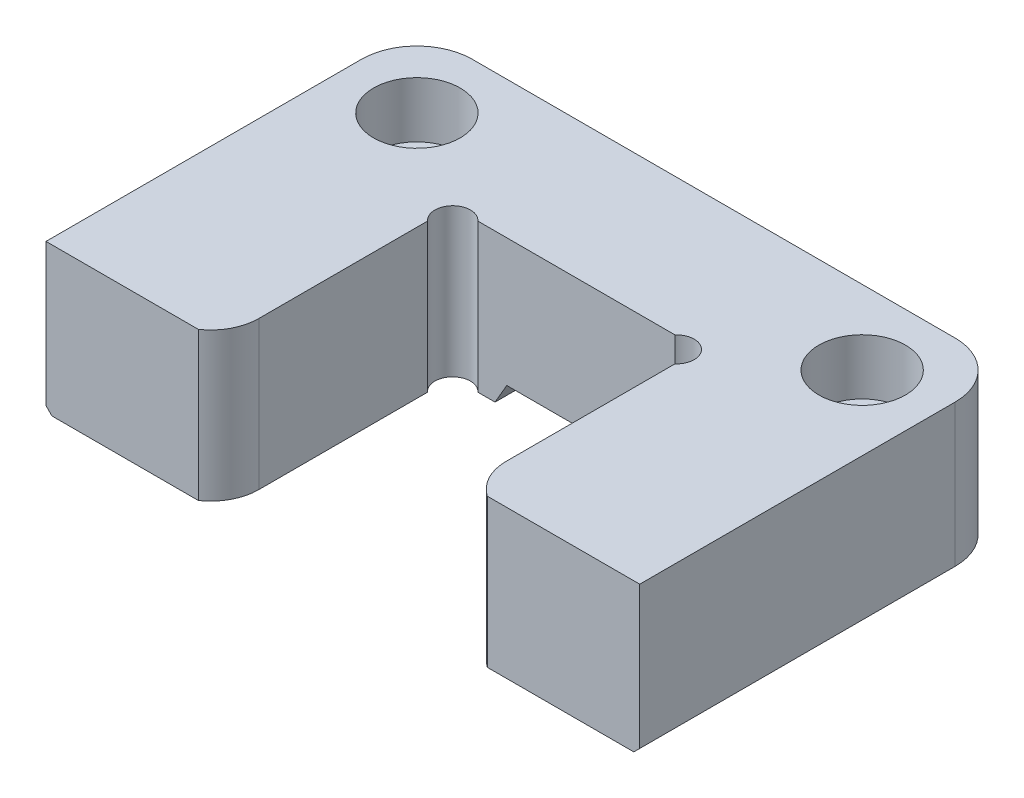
ISO-10303-21;
HEADER;
FILE_DESCRIPTION(('STEP AP214'),'2;1');
FILE_NAME('part.step','',(''),(''),'','','');
FILE_SCHEMA(('AUTOMOTIVE_DESIGN { 1 0 10303 214 1 1 1 1 }'));
ENDSEC;
DATA;
#1=APPLICATION_CONTEXT('core data for automotive mechanical design processes');
#2=APPLICATION_PROTOCOL_DEFINITION('international standard','automotive_design',2000,#1);
#3=PRODUCT_CONTEXT('',#1,'mechanical');
#4=PRODUCT('Part','Part','',(#3));
#5=PRODUCT_RELATED_PRODUCT_CATEGORY('part','',(#4));
#6=PRODUCT_DEFINITION_FORMATION('','',#4);
#7=PRODUCT_DEFINITION_CONTEXT('part definition',#1,'design');
#8=PRODUCT_DEFINITION('design','',#6,#7);
#9=PRODUCT_DEFINITION_SHAPE('','',#8);
#10=(LENGTH_UNIT() NAMED_UNIT(*) SI_UNIT(.MILLI.,.METRE.));
#11=(NAMED_UNIT(*) PLANE_ANGLE_UNIT() SI_UNIT($,.RADIAN.));
#12=(NAMED_UNIT(*) SI_UNIT($,.STERADIAN.) SOLID_ANGLE_UNIT());
#13=UNCERTAINTY_MEASURE_WITH_UNIT(LENGTH_MEASURE(1.E-05),#10,'distance_accuracy_value','');
#14=(GEOMETRIC_REPRESENTATION_CONTEXT(3) GLOBAL_UNCERTAINTY_ASSIGNED_CONTEXT((#13)) GLOBAL_UNIT_ASSIGNED_CONTEXT((#10,
#11,#12)) REPRESENTATION_CONTEXT('',''));
#15=CARTESIAN_POINT('',(0.,0.,0.));
#16=DIRECTION('',(0.,0.,1.));
#17=DIRECTION('',(1.,0.,0.));
#18=AXIS2_PLACEMENT_3D('',#15,#16,#17);
#19=CARTESIAN_POINT('',(-38.1,-19.0246,-47.5996));
#20=DIRECTION('',(0.,-1.,0.));
#21=DIRECTION('',(0.,0.,-1.));
#22=AXIS2_PLACEMENT_3D('',#19,#20,#21);
#23=PLANE('',#22);
#24=CARTESIAN_POINT('',(-28.575,-19.0246,-38.0746));
#25=DIRECTION('',(0.,1.,0.));
#26=DIRECTION('',(0.,0.,1.));
#27=AXIS2_PLACEMENT_3D('',#24,#25,#26);
#28=CIRCLE('',#27,3.26389999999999);
#29=CARTESIAN_POINT('',(-28.575,-19.0246,-34.8107));
#30=VERTEX_POINT('',#29);
#31=EDGE_CURVE('E499',#30,#30,#28,.T.);
#32=ORIENTED_EDGE('',*,*,#31,.T.);
#33=EDGE_LOOP('',(#32));
#34=FACE_BOUND('',#33,.T.);
#35=CARTESIAN_POINT('',(-30.988,-19.0246,-40.4876));
#36=DIRECTION('',(0.,-1.,0.));
#37=DIRECTION('',(0.,0.,-1.));
#38=AXIS2_PLACEMENT_3D('',#35,#36,#37);
#39=CIRCLE('',#38,6.34999999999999);
#40=CARTESIAN_POINT('',(-37.338,-19.0246,-40.4876));
#41=VERTEX_POINT('',#40);
#42=CARTESIAN_POINT('',(-30.988,-19.0246,-46.8376));
#43=VERTEX_POINT('',#42);
#44=EDGE_CURVE('E343',#41,#43,#39,.T.);
#45=ORIENTED_EDGE('',*,*,#44,.T.);
#46=DIRECTION('',(1.,0.,0.));
#47=VECTOR('',#46,1.);
#48=CARTESIAN_POINT('',(-38.1,-19.0246,-46.8376));
#49=LINE('',#48,#47);
#50=CARTESIAN_POINT('',(-10.4415435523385,-19.0246,-46.8376));
#51=VERTEX_POINT('',#50);
#52=EDGE_CURVE('E345',#43,#51,#49,.T.);
#53=ORIENTED_EDGE('',*,*,#52,.T.);
#54=DIRECTION('',(0.,0.,-1.));
#55=VECTOR('',#54,1.);
#56=CARTESIAN_POINT('',(-10.4415435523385,-19.0246,-47.5996));
#57=LINE('',#56,#55);
#58=CARTESIAN_POINT('',(-10.4415435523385,-19.0246,-29.972));
#59=VERTEX_POINT('',#58);
#60=EDGE_CURVE('E320',#59,#51,#57,.T.);
#61=ORIENTED_EDGE('',*,*,#60,.F.);
#62=DIRECTION('',(1.,0.,0.));
#63=VECTOR('',#62,1.);
#64=CARTESIAN_POINT('',(-15.875,-19.0246,-29.972));
#65=LINE('',#64,#63);
#66=CARTESIAN_POINT('',(-12.6471162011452,-19.0246,-29.972));
#67=VERTEX_POINT('',#66);
#68=EDGE_CURVE('E271',#67,#59,#65,.T.);
#69=ORIENTED_EDGE('',*,*,#68,.F.);
#70=CARTESIAN_POINT('',(-14.351,-19.0246,-28.448));
#71=DIRECTION('',(0.,1.,0.));
#72=DIRECTION('',(0.,0.,1.));
#73=AXIS2_PLACEMENT_3D('',#70,#71,#72);
#74=CIRCLE('',#73,2.286);
#75=CARTESIAN_POINT('',(-15.875,-19.0246,-26.7441162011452));
#76=VERTEX_POINT('',#75);
#77=EDGE_CURVE('E233',#67,#76,#74,.T.);
#78=ORIENTED_EDGE('',*,*,#77,.T.);
#79=DIRECTION('',(0.,0.,-1.));
#80=VECTOR('',#79,1.);
#81=CARTESIAN_POINT('',(-15.875,-19.0246,0.));
#82=LINE('',#81,#80);
#83=CARTESIAN_POINT('',(-15.875,-19.0246,-5.08));
#84=VERTEX_POINT('',#83);
#85=EDGE_CURVE('E266',#84,#76,#82,.T.);
#86=ORIENTED_EDGE('',*,*,#85,.F.);
#87=CARTESIAN_POINT('',(-22.0455393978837,-19.0246,-5.07999999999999));
#88=DIRECTION('',(0.,-1.,0.));
#89=DIRECTION('',(0.,0.,1.));
#90=AXIS2_PLACEMENT_3D('',#87,#88,#89);
#91=CIRCLE('',#90,6.17053939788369);
#92=CARTESIAN_POINT('',(-18.5428038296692,-19.0246,0.));
#93=VERTEX_POINT('',#92);
#94=EDGE_CURVE('E242',#84,#93,#91,.T.);
#95=ORIENTED_EDGE('',*,*,#94,.T.);
#96=DIRECTION('',(1.,0.,0.));
#97=VECTOR('',#96,1.);
#98=CARTESIAN_POINT('',(-38.1,-19.0246,0.));
#99=LINE('',#98,#97);
#100=CARTESIAN_POINT('',(-37.338,-19.0246,0.));
#101=VERTEX_POINT('',#100);
#102=EDGE_CURVE('E264',#101,#93,#99,.T.);
#103=ORIENTED_EDGE('',*,*,#102,.F.);
#104=DIRECTION('',(0.,0.,-1.));
#105=VECTOR('',#104,1.);
#106=CARTESIAN_POINT('',(-37.338,-19.0246,-47.5996));
#107=LINE('',#106,#105);
#108=EDGE_CURVE('E341',#101,#41,#107,.T.);
#109=ORIENTED_EDGE('',*,*,#108,.T.);
#110=EDGE_LOOP('',(#45,#53,#61,#69,#78,#86,#95,#103,#109));
#111=FACE_BOUND('',#110,.T.);
#112=ADVANCED_FACE('F35',(#34,#111),#23,.T.);
#113=CARTESIAN_POINT('',(-38.1,-19.0246,0.));
#114=DIRECTION('',(-1.,0.,0.));
#115=DIRECTION('',(0.,0.,1.));
#116=AXIS2_PLACEMENT_3D('',#113,#114,#115);
#117=PLANE('',#116);
#118=DIRECTION('',(0.,1.,0.));
#119=VECTOR('',#118,1.);
#120=CARTESIAN_POINT('',(-38.1,-19.0246,-40.4876));
#121=LINE('',#120,#119);
#122=CARTESIAN_POINT('',(-38.1,0.,-40.4876));
#123=VERTEX_POINT('',#122);
#124=CARTESIAN_POINT('',(-38.1,-18.2626,-40.4876));
#125=VERTEX_POINT('',#124);
#126=EDGE_CURVE('E312',#123,#125,#121,.F.);
#127=ORIENTED_EDGE('',*,*,#126,.T.);
#128=DIRECTION('',(0.,0.,1.));
#129=VECTOR('',#128,1.);
#130=CARTESIAN_POINT('',(-38.1,-18.2626,0.));
#131=LINE('',#130,#129);
#132=CARTESIAN_POINT('',(-38.1,-18.2626,0.));
#133=VERTEX_POINT('',#132);
#134=EDGE_CURVE('E350',#125,#133,#131,.T.);
#135=ORIENTED_EDGE('',*,*,#134,.T.);
#136=DIRECTION('',(0.,1.,0.));
#137=VECTOR('',#136,1.);
#138=CARTESIAN_POINT('',(-38.1,-19.0246,0.));
#139=LINE('',#138,#137);
#140=CARTESIAN_POINT('',(-38.1,0.,0.));
#141=VERTEX_POINT('',#140);
#142=EDGE_CURVE('E278',#133,#141,#139,.T.);
#143=ORIENTED_EDGE('',*,*,#142,.T.);
#144=DIRECTION('',(0.,0.,1.));
#145=VECTOR('',#144,1.);
#146=CARTESIAN_POINT('',(-38.1,0.,0.));
#147=LINE('',#146,#145);
#148=EDGE_CURVE('E256',#123,#141,#147,.T.);
#149=ORIENTED_EDGE('',*,*,#148,.F.);
#150=EDGE_LOOP('',(#127,#135,#143,#149));
#151=FACE_BOUND('',#150,.T.);
#152=ADVANCED_FACE('F425',(#151),#117,.T.);
#153=CARTESIAN_POINT('',(-38.1,-19.0246,-47.5996));
#154=DIRECTION('',(0.,0.,-1.));
#155=DIRECTION('',(-1.,0.,0.));
#156=AXIS2_PLACEMENT_3D('',#153,#154,#155);
#157=PLANE('',#156);
#158=DIRECTION('',(0.,1.,0.));
#159=VECTOR('',#158,1.);
#160=CARTESIAN_POINT('',(30.988,-19.0246,-47.5996));
#161=LINE('',#160,#159);
#162=CARTESIAN_POINT('',(30.988,0.,-47.5996));
#163=VERTEX_POINT('',#162);
#164=CARTESIAN_POINT('',(30.988,-18.2626,-47.5996));
#165=VERTEX_POINT('',#164);
#166=EDGE_CURVE('E310',#163,#165,#161,.F.);
#167=ORIENTED_EDGE('',*,*,#166,.T.);
#168=DIRECTION('',(-1.,0.,0.));
#169=VECTOR('',#168,1.);
#170=CARTESIAN_POINT('',(-38.1,-18.2626,-47.5996));
#171=LINE('',#170,#169);
#172=CARTESIAN_POINT('',(10.001602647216,-18.2626,-47.5996));
#173=VERTEX_POINT('',#172);
#174=EDGE_CURVE('E337',#165,#173,#171,.T.);
#175=ORIENTED_EDGE('',*,*,#174,.T.);
#176=DIRECTION('',(0.499999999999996,-0.866025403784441,0.));
#177=VECTOR('',#176,1.);
#178=CARTESIAN_POINT('',(9.525,-17.4371,-47.5996));
#179=LINE('',#178,#177);
#180=CARTESIAN_POINT('',(9.525,-17.4371,-47.5996));
#181=VERTEX_POINT('',#180);
#182=EDGE_CURVE('E201',#181,#173,#179,.T.);
#183=ORIENTED_EDGE('',*,*,#182,.F.);
#184=DIRECTION('',(1.,0.,0.));
#185=VECTOR('',#184,1.);
#186=CARTESIAN_POINT('',(9.525,-17.4371,-47.5996));
#187=LINE('',#186,#185);
#188=CARTESIAN_POINT('',(-9.525,-17.4371,-47.5996));
#189=VERTEX_POINT('',#188);
#190=EDGE_CURVE('E195',#189,#181,#187,.T.);
#191=ORIENTED_EDGE('',*,*,#190,.F.);
#192=DIRECTION('',(0.499999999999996,0.866025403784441,0.));
#193=VECTOR('',#192,1.);
#194=CARTESIAN_POINT('',(-9.525,-17.4371,-47.5996));
#195=LINE('',#194,#193);
#196=CARTESIAN_POINT('',(-10.001602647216,-18.2626,-47.5996));
#197=VERTEX_POINT('',#196);
#198=EDGE_CURVE('E204',#197,#189,#195,.T.);
#199=ORIENTED_EDGE('',*,*,#198,.F.);
#200=DIRECTION('',(-1.,0.,0.));
#201=VECTOR('',#200,1.);
#202=CARTESIAN_POINT('',(-38.1,-18.2626,-47.5996));
#203=LINE('',#202,#201);
#204=CARTESIAN_POINT('',(-30.988,-18.2626,-47.5996));
#205=VERTEX_POINT('',#204);
#206=EDGE_CURVE('E335',#197,#205,#203,.T.);
#207=ORIENTED_EDGE('',*,*,#206,.T.);
#208=DIRECTION('',(0.,1.,0.));
#209=VECTOR('',#208,1.);
#210=CARTESIAN_POINT('',(-30.988,-19.0246,-47.5996));
#211=LINE('',#210,#209);
#212=CARTESIAN_POINT('',(-30.988,0.,-47.5996));
#213=VERTEX_POINT('',#212);
#214=EDGE_CURVE('E308',#205,#213,#211,.T.);
#215=ORIENTED_EDGE('',*,*,#214,.T.);
#216=DIRECTION('',(-1.,0.,0.));
#217=VECTOR('',#216,1.);
#218=CARTESIAN_POINT('',(-38.1,0.,-47.5996));
#219=LINE('',#218,#217);
#220=EDGE_CURVE('E267',#163,#213,#219,.T.);
#221=ORIENTED_EDGE('',*,*,#220,.F.);
#222=EDGE_LOOP('',(#167,#175,#183,#191,#199,#207,#215,#221));
#223=FACE_BOUND('',#222,.T.);
#224=ADVANCED_FACE('F215',(#223),#157,.T.);
#225=CARTESIAN_POINT('',(38.1,-19.0246,0.));
#226=DIRECTION('',(1.,0.,0.));
#227=DIRECTION('',(0.,0.,-1.));
#228=AXIS2_PLACEMENT_3D('',#225,#226,#227);
#229=PLANE('',#228);
#230=DIRECTION('',(0.,1.,0.));
#231=VECTOR('',#230,1.);
#232=CARTESIAN_POINT('',(38.1,-19.0246,0.));
#233=LINE('',#232,#231);
#234=CARTESIAN_POINT('',(38.1,-18.2626,0.));
#235=VERTEX_POINT('',#234);
#236=CARTESIAN_POINT('',(38.1,0.,0.));
#237=VERTEX_POINT('',#236);
#238=EDGE_CURVE('E299',#235,#237,#233,.T.);
#239=ORIENTED_EDGE('',*,*,#238,.F.);
#240=DIRECTION('',(0.,0.,-1.));
#241=VECTOR('',#240,1.);
#242=CARTESIAN_POINT('',(38.1,-18.2626,0.));
#243=LINE('',#242,#241);
#244=CARTESIAN_POINT('',(38.1,-18.2626,-40.4876));
#245=VERTEX_POINT('',#244);
#246=EDGE_CURVE('E322',#235,#245,#243,.T.);
#247=ORIENTED_EDGE('',*,*,#246,.T.);
#248=DIRECTION('',(0.,1.,0.));
#249=VECTOR('',#248,1.);
#250=CARTESIAN_POINT('',(38.1,-19.0246,-40.4876));
#251=LINE('',#250,#249);
#252=CARTESIAN_POINT('',(38.1,0.,-40.4876));
#253=VERTEX_POINT('',#252);
#254=EDGE_CURVE('E301',#245,#253,#251,.T.);
#255=ORIENTED_EDGE('',*,*,#254,.T.);
#256=DIRECTION('',(0.,0.,-1.));
#257=VECTOR('',#256,1.);
#258=CARTESIAN_POINT('',(38.1,0.,0.));
#259=LINE('',#258,#257);
#260=EDGE_CURVE('E294',#237,#253,#259,.T.);
#261=ORIENTED_EDGE('',*,*,#260,.F.);
#262=EDGE_LOOP('',(#239,#247,#255,#261));
#263=FACE_BOUND('',#262,.T.);
#264=ADVANCED_FACE('F411',(#263),#229,.T.);
#265=CARTESIAN_POINT('',(15.875,-19.0246,0.));
#266=DIRECTION('',(0.,0.,1.));
#267=DIRECTION('',(1.,0.,0.));
#268=AXIS2_PLACEMENT_3D('',#265,#266,#267);
#269=PLANE('',#268);
#270=DIRECTION('',(1.,0.,0.));
#271=VECTOR('',#270,1.);
#272=CARTESIAN_POINT('',(15.875,-19.0246,0.));
#273=LINE('',#272,#271);
#274=CARTESIAN_POINT('',(18.5428038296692,-19.0246,0.));
#275=VERTEX_POINT('',#274);
#276=CARTESIAN_POINT('',(37.338,-19.0246,0.));
#277=VERTEX_POINT('',#276);
#278=EDGE_CURVE('E275',#275,#277,#273,.T.);
#279=ORIENTED_EDGE('',*,*,#278,.T.);
#280=DIRECTION('',(-0.707106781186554,-0.707106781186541,0.));
#281=VECTOR('',#280,1.);
#282=CARTESIAN_POINT('',(26.6064999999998,-29.7561,0.));
#283=LINE('',#282,#281);
#284=EDGE_CURVE('E331',#277,#235,#283,.F.);
#285=ORIENTED_EDGE('',*,*,#284,.T.);
#286=ORIENTED_EDGE('',*,*,#238,.T.);
#287=DIRECTION('',(1.,0.,0.));
#288=VECTOR('',#287,1.);
#289=CARTESIAN_POINT('',(15.875,0.,0.));
#290=LINE('',#289,#288);
#291=CARTESIAN_POINT('',(18.5428038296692,0.,0.));
#292=VERTEX_POINT('',#291);
#293=EDGE_CURVE('E291',#292,#237,#290,.T.);
#294=ORIENTED_EDGE('',*,*,#293,.F.);
#295=DIRECTION('',(0.,1.,0.));
#296=VECTOR('',#295,1.);
#297=CARTESIAN_POINT('',(18.5428038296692,-19.0246,0.));
#298=LINE('',#297,#296);
#299=EDGE_CURVE('E260',#275,#292,#298,.T.);
#300=ORIENTED_EDGE('',*,*,#299,.F.);
#301=EDGE_LOOP('',(#279,#285,#286,#294,#300));
#302=FACE_BOUND('',#301,.T.);
#303=ADVANCED_FACE('F394',(#302),#269,.T.);
#304=CARTESIAN_POINT('',(15.875,-19.0246,0.));
#305=DIRECTION('',(-1.,0.,0.));
#306=DIRECTION('',(0.,0.,1.));
#307=AXIS2_PLACEMENT_3D('',#304,#305,#306);
#308=PLANE('',#307);
#309=DIRECTION('',(0.,1.,0.));
#310=VECTOR('',#309,1.);
#311=CARTESIAN_POINT('',(15.875,-19.0246,-26.7441162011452));
#312=LINE('',#311,#310);
#313=CARTESIAN_POINT('',(15.875,-19.0246,-26.7441162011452));
#314=VERTEX_POINT('',#313);
#315=CARTESIAN_POINT('',(15.875,0.,-26.7441162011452));
#316=VERTEX_POINT('',#315);
#317=EDGE_CURVE('E230',#314,#316,#312,.T.);
#318=ORIENTED_EDGE('',*,*,#317,.F.);
#319=DIRECTION('',(0.,0.,1.));
#320=VECTOR('',#319,1.);
#321=CARTESIAN_POINT('',(15.875,-19.0246,0.));
#322=LINE('',#321,#320);
#323=CARTESIAN_POINT('',(15.875,-19.0246,-5.08));
#324=VERTEX_POINT('',#323);
#325=EDGE_CURVE('E273',#314,#324,#322,.T.);
#326=ORIENTED_EDGE('',*,*,#325,.T.);
#327=DIRECTION('',(0.,1.,0.));
#328=VECTOR('',#327,1.);
#329=CARTESIAN_POINT('',(15.875,-19.0246,-5.08));
#330=LINE('',#329,#328);
#331=CARTESIAN_POINT('',(15.875,0.,-5.08));
#332=VERTEX_POINT('',#331);
#333=EDGE_CURVE('E257',#324,#332,#330,.T.);
#334=ORIENTED_EDGE('',*,*,#333,.T.);
#335=DIRECTION('',(0.,0.,1.));
#336=VECTOR('',#335,1.);
#337=CARTESIAN_POINT('',(15.875,0.,0.));
#338=LINE('',#337,#336);
#339=EDGE_CURVE('E289',#316,#332,#338,.T.);
#340=ORIENTED_EDGE('',*,*,#339,.F.);
#341=EDGE_LOOP('',(#318,#326,#334,#340));
#342=FACE_BOUND('',#341,.T.);
#343=ADVANCED_FACE('F383',(#342),#308,.T.);
#344=CARTESIAN_POINT('',(-15.875,-19.0246,-29.972));
#345=DIRECTION('',(0.,0.,1.));
#346=DIRECTION('',(1.,0.,0.));
#347=AXIS2_PLACEMENT_3D('',#344,#345,#346);
#348=PLANE('',#347);
#349=DIRECTION('',(-0.499999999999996,-0.866025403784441,0.));
#350=VECTOR('',#349,1.);
#351=CARTESIAN_POINT('',(-11.7999076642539,-21.3773556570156,-29.972));
#352=LINE('',#351,#350);
#353=CARTESIAN_POINT('',(-8.93559094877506,-16.4162135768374,-29.972));
#354=VERTEX_POINT('',#353);
#355=EDGE_CURVE('E50',#354,#59,#352,.T.);
#356=ORIENTED_EDGE('',*,*,#355,.F.);
#357=DIRECTION('',(1.,0.,0.));
#358=VECTOR('',#357,1.);
#359=CARTESIAN_POINT('',(9.525,-16.4162135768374,-29.972));
#360=LINE('',#359,#358);
#361=CARTESIAN_POINT('',(8.93559094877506,-16.4162135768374,-29.972));
#362=VERTEX_POINT('',#361);
#363=EDGE_CURVE('E365',#354,#362,#360,.T.);
#364=ORIENTED_EDGE('',*,*,#363,.T.);
#365=DIRECTION('',(-0.499999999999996,0.866025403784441,0.));
#366=VECTOR('',#365,1.);
#367=CARTESIAN_POINT('',(3.86240766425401,-7.6292023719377,-29.972));
#368=LINE('',#367,#366);
#369=CARTESIAN_POINT('',(10.4415435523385,-19.0246,-29.972));
#370=VERTEX_POINT('',#369);
#371=EDGE_CURVE('E57',#370,#362,#368,.T.);
#372=ORIENTED_EDGE('',*,*,#371,.F.);
#373=CARTESIAN_POINT('',(12.6471162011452,-19.0246,-29.972));
#374=VERTEX_POINT('',#373);
#375=EDGE_CURVE('E270',#370,#374,#65,.T.);
#376=ORIENTED_EDGE('',*,*,#375,.T.);
#377=DIRECTION('',(0.,1.,0.));
#378=VECTOR('',#377,1.);
#379=CARTESIAN_POINT('',(12.6471162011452,-19.0246,-29.972));
#380=LINE('',#379,#378);
#381=CARTESIAN_POINT('',(12.6471162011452,0.,-29.972));
#382=VERTEX_POINT('',#381);
#383=EDGE_CURVE('E227',#382,#374,#380,.F.);
#384=ORIENTED_EDGE('',*,*,#383,.F.);
#385=DIRECTION('',(1.,0.,0.));
#386=VECTOR('',#385,1.);
#387=CARTESIAN_POINT('',(-15.875,0.,-29.972));
#388=LINE('',#387,#386);
#389=CARTESIAN_POINT('',(-12.6471162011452,0.,-29.972));
#390=VERTEX_POINT('',#389);
#391=EDGE_CURVE('E286',#390,#382,#388,.T.);
#392=ORIENTED_EDGE('',*,*,#391,.F.);
#393=DIRECTION('',(0.,1.,0.));
#394=VECTOR('',#393,1.);
#395=CARTESIAN_POINT('',(-12.6471162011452,-19.0246,-29.972));
#396=LINE('',#395,#394);
#397=EDGE_CURVE('E239',#67,#390,#396,.T.);
#398=ORIENTED_EDGE('',*,*,#397,.F.);
#399=ORIENTED_EDGE('',*,*,#68,.T.);
#400=EDGE_LOOP('',(#356,#364,#372,#376,#384,#392,#398,#399));
#401=FACE_BOUND('',#400,.T.);
#402=ADVANCED_FACE('F370',(#401),#348,.T.);
#403=CARTESIAN_POINT('',(-15.875,-19.0246,0.));
#404=DIRECTION('',(1.,0.,0.));
#405=DIRECTION('',(0.,0.,-1.));
#406=AXIS2_PLACEMENT_3D('',#403,#404,#405);
#407=PLANE('',#406);
#408=DIRECTION('',(0.,1.,0.));
#409=VECTOR('',#408,1.);
#410=CARTESIAN_POINT('',(-15.875,-19.0246,-26.7441162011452));
#411=LINE('',#410,#409);
#412=CARTESIAN_POINT('',(-15.875,0.,-26.7441162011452));
#413=VERTEX_POINT('',#412);
#414=EDGE_CURVE('E236',#413,#76,#411,.F.);
#415=ORIENTED_EDGE('',*,*,#414,.F.);
#416=DIRECTION('',(0.,0.,-1.));
#417=VECTOR('',#416,1.);
#418=CARTESIAN_POINT('',(-15.875,0.,0.));
#419=LINE('',#418,#417);
#420=CARTESIAN_POINT('',(-15.875,0.,-5.08));
#421=VERTEX_POINT('',#420);
#422=EDGE_CURVE('E283',#421,#413,#419,.T.);
#423=ORIENTED_EDGE('',*,*,#422,.F.);
#424=DIRECTION('',(0.,1.,0.));
#425=VECTOR('',#424,1.);
#426=CARTESIAN_POINT('',(-15.875,-19.0246,-5.08));
#427=LINE('',#426,#425);
#428=EDGE_CURVE('E254',#84,#421,#427,.T.);
#429=ORIENTED_EDGE('',*,*,#428,.F.);
#430=ORIENTED_EDGE('',*,*,#85,.T.);
#431=EDGE_LOOP('',(#415,#423,#429,#430));
#432=FACE_BOUND('',#431,.T.);
#433=ADVANCED_FACE('F449',(#432),#407,.T.);
#434=CARTESIAN_POINT('',(-38.1,-19.0246,0.));
#435=DIRECTION('',(0.,0.,1.));
#436=DIRECTION('',(1.,0.,0.));
#437=AXIS2_PLACEMENT_3D('',#434,#435,#436);
#438=PLANE('',#437);
#439=ORIENTED_EDGE('',*,*,#142,.F.);
#440=DIRECTION('',(-0.707106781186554,0.707106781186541,0.));
#441=VECTOR('',#440,1.);
#442=CARTESIAN_POINT('',(-37.719,-18.6436,0.));
#443=LINE('',#442,#441);
#444=EDGE_CURVE('E352',#133,#101,#443,.F.);
#445=ORIENTED_EDGE('',*,*,#444,.T.);
#446=ORIENTED_EDGE('',*,*,#102,.T.);
#447=DIRECTION('',(0.,1.,0.));
#448=VECTOR('',#447,1.);
#449=CARTESIAN_POINT('',(-18.5428038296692,-19.0246,0.));
#450=LINE('',#449,#448);
#451=CARTESIAN_POINT('',(-18.5428038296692,0.,0.));
#452=VERTEX_POINT('',#451);
#453=EDGE_CURVE('E249',#93,#452,#450,.T.);
#454=ORIENTED_EDGE('',*,*,#453,.T.);
#455=DIRECTION('',(1.,0.,0.));
#456=VECTOR('',#455,1.);
#457=CARTESIAN_POINT('',(-38.1,0.,0.));
#458=LINE('',#457,#456);
#459=EDGE_CURVE('E281',#141,#452,#458,.T.);
#460=ORIENTED_EDGE('',*,*,#459,.F.);
#461=EDGE_LOOP('',(#439,#445,#446,#454,#460));
#462=FACE_BOUND('',#461,.T.);
#463=ADVANCED_FACE('F430',(#462),#438,.T.);
#464=CARTESIAN_POINT('',(28.575,-19.0246,-38.0746));
#465=DIRECTION('',(0.,1.,0.));
#466=DIRECTION('',(0.,0.,1.));
#467=AXIS2_PLACEMENT_3D('',#464,#465,#466);
#468=CIRCLE('',#467,3.26389999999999);
#469=CARTESIAN_POINT('',(28.575,-19.0246,-34.8107));
#470=VERTEX_POINT('',#469);
#471=EDGE_CURVE('E361',#470,#470,#468,.T.);
#472=ORIENTED_EDGE('',*,*,#471,.T.);
#473=EDGE_LOOP('',(#472));
#474=FACE_BOUND('',#473,.T.);
#475=CARTESIAN_POINT('',(30.988,-19.0246,-40.4876));
#476=DIRECTION('',(0.,-1.,0.));
#477=DIRECTION('',(0.,0.,-1.));
#478=AXIS2_PLACEMENT_3D('',#475,#476,#477);
#479=CIRCLE('',#478,6.34999999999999);
#480=CARTESIAN_POINT('',(30.988,-19.0246,-46.8376));
#481=VERTEX_POINT('',#480);
#482=CARTESIAN_POINT('',(37.338,-19.0246,-40.4876));
#483=VERTEX_POINT('',#482);
#484=EDGE_CURVE('E327',#481,#483,#479,.T.);
#485=ORIENTED_EDGE('',*,*,#484,.T.);
#486=DIRECTION('',(0.,0.,1.));
#487=VECTOR('',#486,1.);
#488=CARTESIAN_POINT('',(37.338,-19.0246,-47.5996));
#489=LINE('',#488,#487);
#490=EDGE_CURVE('E329',#483,#277,#489,.T.);
#491=ORIENTED_EDGE('',*,*,#490,.T.);
#492=ORIENTED_EDGE('',*,*,#278,.F.);
#493=CARTESIAN_POINT('',(22.0455393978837,-19.0246,-5.07999999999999));
#494=DIRECTION('',(0.,-1.,0.));
#495=DIRECTION('',(0.,0.,-1.));
#496=AXIS2_PLACEMENT_3D('',#493,#494,#495);
#497=CIRCLE('',#496,6.17053939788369);
#498=EDGE_CURVE('E245',#275,#324,#497,.T.);
#499=ORIENTED_EDGE('',*,*,#498,.T.);
#500=ORIENTED_EDGE('',*,*,#325,.F.);
#501=CARTESIAN_POINT('',(14.351,-19.0246,-28.448));
#502=DIRECTION('',(0.,1.,0.));
#503=DIRECTION('',(0.,0.,-1.));
#504=AXIS2_PLACEMENT_3D('',#501,#502,#503);
#505=CIRCLE('',#504,2.286);
#506=EDGE_CURVE('E224',#314,#374,#505,.T.);
#507=ORIENTED_EDGE('',*,*,#506,.T.);
#508=ORIENTED_EDGE('',*,*,#375,.F.);
#509=DIRECTION('',(0.,0.,1.));
#510=VECTOR('',#509,1.);
#511=CARTESIAN_POINT('',(10.4415435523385,-19.0246,-47.5996));
#512=LINE('',#511,#510);
#513=CARTESIAN_POINT('',(10.4415435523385,-19.0246,-46.8376));
#514=VERTEX_POINT('',#513);
#515=EDGE_CURVE('E318',#514,#370,#512,.T.);
#516=ORIENTED_EDGE('',*,*,#515,.F.);
#517=DIRECTION('',(1.,0.,0.));
#518=VECTOR('',#517,1.);
#519=CARTESIAN_POINT('',(-38.1,-19.0246,-46.8376));
#520=LINE('',#519,#518);
#521=EDGE_CURVE('E325',#514,#481,#520,.T.);
#522=ORIENTED_EDGE('',*,*,#521,.T.);
#523=EDGE_LOOP('',(#485,#491,#492,#499,#500,#507,#508,#516,#522));
#524=FACE_BOUND('',#523,.T.);
#525=ADVANCED_FACE('F375',(#474,#524),#23,.T.);
#526=CARTESIAN_POINT('',(-38.1,0.,-47.5996));
#527=DIRECTION('',(0.,-1.,0.));
#528=DIRECTION('',(0.,0.,-1.));
#529=AXIS2_PLACEMENT_3D('',#526,#527,#528);
#530=PLANE('',#529);
#531=CARTESIAN_POINT('',(-28.575,0.,-38.0746));
#532=DIRECTION('',(0.,1.,0.));
#533=DIRECTION('',(0.,0.,1.));
#534=AXIS2_PLACEMENT_3D('',#531,#532,#533);
#535=CIRCLE('',#534,5.55625);
#536=CARTESIAN_POINT('',(-28.575,0.,-32.51835));
#537=VERTEX_POINT('',#536);
#538=EDGE_CURVE('E507',#537,#537,#535,.T.);
#539=ORIENTED_EDGE('',*,*,#538,.F.);
#540=EDGE_LOOP('',(#539));
#541=FACE_BOUND('',#540,.T.);
#542=CARTESIAN_POINT('',(28.575,0.,-38.0746));
#543=DIRECTION('',(0.,1.,0.));
#544=DIRECTION('',(0.,0.,1.));
#545=AXIS2_PLACEMENT_3D('',#542,#543,#544);
#546=CIRCLE('',#545,5.55625);
#547=CARTESIAN_POINT('',(28.575,0.,-32.51835));
#548=VERTEX_POINT('',#547);
#549=EDGE_CURVE('E496',#548,#548,#546,.T.);
#550=ORIENTED_EDGE('',*,*,#549,.F.);
#551=EDGE_LOOP('',(#550));
#552=FACE_BOUND('',#551,.T.);
#553=ORIENTED_EDGE('',*,*,#391,.T.);
#554=CARTESIAN_POINT('',(14.351,0.,-28.448));
#555=DIRECTION('',(0.,-1.,0.));
#556=DIRECTION('',(0.,0.,-1.));
#557=AXIS2_PLACEMENT_3D('',#554,#555,#556);
#558=CIRCLE('',#557,2.286);
#559=EDGE_CURVE('E315',#382,#316,#558,.T.);
#560=ORIENTED_EDGE('',*,*,#559,.T.);
#561=ORIENTED_EDGE('',*,*,#339,.T.);
#562=CARTESIAN_POINT('',(22.0455393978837,0.,-5.07999999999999));
#563=DIRECTION('',(0.,-1.,0.));
#564=DIRECTION('',(0.,0.,-1.));
#565=AXIS2_PLACEMENT_3D('',#562,#563,#564);
#566=CIRCLE('',#565,6.17053939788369);
#567=EDGE_CURVE('E246',#292,#332,#566,.T.);
#568=ORIENTED_EDGE('',*,*,#567,.F.);
#569=ORIENTED_EDGE('',*,*,#293,.T.);
#570=ORIENTED_EDGE('',*,*,#260,.T.);
#571=CARTESIAN_POINT('',(30.988,0.,-40.4876));
#572=DIRECTION('',(0.,-1.,0.));
#573=DIRECTION('',(0.,0.,-1.));
#574=AXIS2_PLACEMENT_3D('',#571,#572,#573);
#575=CIRCLE('',#574,7.112);
#576=EDGE_CURVE('E306',#253,#163,#575,.F.);
#577=ORIENTED_EDGE('',*,*,#576,.T.);
#578=ORIENTED_EDGE('',*,*,#220,.T.);
#579=CARTESIAN_POINT('',(-30.988,0.,-40.4876));
#580=DIRECTION('',(0.,-1.,0.));
#581=DIRECTION('',(0.,0.,-1.));
#582=AXIS2_PLACEMENT_3D('',#579,#580,#581);
#583=CIRCLE('',#582,7.112);
#584=EDGE_CURVE('E304',#213,#123,#583,.F.);
#585=ORIENTED_EDGE('',*,*,#584,.T.);
#586=ORIENTED_EDGE('',*,*,#148,.T.);
#587=ORIENTED_EDGE('',*,*,#459,.T.);
#588=CARTESIAN_POINT('',(-22.0455393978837,0.,-5.07999999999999));
#589=DIRECTION('',(0.,-1.,0.));
#590=DIRECTION('',(0.,0.,1.));
#591=AXIS2_PLACEMENT_3D('',#588,#589,#590);
#592=CIRCLE('',#591,6.17053939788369);
#593=EDGE_CURVE('E241',#421,#452,#592,.T.);
#594=ORIENTED_EDGE('',*,*,#593,.F.);
#595=ORIENTED_EDGE('',*,*,#422,.T.);
#596=CARTESIAN_POINT('',(-14.351,0.,-28.448));
#597=DIRECTION('',(0.,1.,0.));
#598=DIRECTION('',(0.,0.,1.));
#599=AXIS2_PLACEMENT_3D('',#596,#597,#598);
#600=CIRCLE('',#599,2.286);
#601=EDGE_CURVE('E232',#390,#413,#600,.T.);
#602=ORIENTED_EDGE('',*,*,#601,.F.);
#603=EDGE_LOOP('',(#553,#560,#561,#568,#569,#570,#577,#578,#585,#586,#587,#594,#595,#602));
#604=FACE_BOUND('',#603,.T.);
#605=ADVANCED_FACE('F387',(#541,#552,#604),#530,.F.);
#606=CARTESIAN_POINT('',(30.988,-19.0246,-40.4876));
#607=DIRECTION('',(0.,1.,0.));
#608=DIRECTION('',(0.,0.,1.));
#609=AXIS2_PLACEMENT_3D('',#606,#607,#608);
#610=CYLINDRICAL_SURFACE('',#609,7.112);
#611=ORIENTED_EDGE('',*,*,#254,.F.);
#612=CARTESIAN_POINT('',(30.988,-18.2626,-40.4876));
#613=DIRECTION('',(0.,-1.,0.));
#614=DIRECTION('',(0.,0.,-1.));
#615=AXIS2_PLACEMENT_3D('',#612,#613,#614);
#616=CIRCLE('',#615,7.112);
#617=EDGE_CURVE('E333',#245,#165,#616,.F.);
#618=ORIENTED_EDGE('',*,*,#617,.T.);
#619=ORIENTED_EDGE('',*,*,#166,.F.);
#620=ORIENTED_EDGE('',*,*,#576,.F.);
#621=EDGE_LOOP('',(#611,#618,#619,#620));
#622=FACE_BOUND('',#621,.T.);
#623=ADVANCED_FACE('F414',(#622),#610,.T.);
#624=CARTESIAN_POINT('',(-30.988,-19.0246,-40.4876));
#625=DIRECTION('',(0.,1.,0.));
#626=DIRECTION('',(0.,0.,1.));
#627=AXIS2_PLACEMENT_3D('',#624,#625,#626);
#628=CYLINDRICAL_SURFACE('',#627,7.112);
#629=ORIENTED_EDGE('',*,*,#214,.F.);
#630=CARTESIAN_POINT('',(-30.988,-18.2626,-40.4876));
#631=DIRECTION('',(0.,-1.,0.));
#632=DIRECTION('',(0.,0.,-1.));
#633=AXIS2_PLACEMENT_3D('',#630,#631,#632);
#634=CIRCLE('',#633,7.112);
#635=EDGE_CURVE('E348',#205,#125,#634,.F.);
#636=ORIENTED_EDGE('',*,*,#635,.T.);
#637=ORIENTED_EDGE('',*,*,#126,.F.);
#638=ORIENTED_EDGE('',*,*,#584,.F.);
#639=EDGE_LOOP('',(#629,#636,#637,#638));
#640=FACE_BOUND('',#639,.T.);
#641=ADVANCED_FACE('F421',(#640),#628,.T.);
#642=CARTESIAN_POINT('',(22.0455393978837,-19.0246,-5.07999999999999));
#643=DIRECTION('',(0.,1.,0.));
#644=DIRECTION('',(0.,0.,1.));
#645=AXIS2_PLACEMENT_3D('',#642,#643,#644);
#646=CYLINDRICAL_SURFACE('',#645,6.17053939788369);
#647=ORIENTED_EDGE('',*,*,#567,.T.);
#648=ORIENTED_EDGE('',*,*,#333,.F.);
#649=ORIENTED_EDGE('',*,*,#498,.F.);
#650=ORIENTED_EDGE('',*,*,#299,.T.);
#651=EDGE_LOOP('',(#647,#648,#649,#650));
#652=FACE_BOUND('',#651,.T.);
#653=ADVANCED_FACE('F390',(#652),#646,.T.);
#654=CARTESIAN_POINT('',(-22.0455393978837,-19.0246,-5.07999999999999));
#655=DIRECTION('',(0.,1.,0.));
#656=DIRECTION('',(0.,0.,1.));
#657=AXIS2_PLACEMENT_3D('',#654,#655,#656);
#658=CYLINDRICAL_SURFACE('',#657,6.17053939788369);
#659=ORIENTED_EDGE('',*,*,#593,.T.);
#660=ORIENTED_EDGE('',*,*,#453,.F.);
#661=ORIENTED_EDGE('',*,*,#94,.F.);
#662=ORIENTED_EDGE('',*,*,#428,.T.);
#663=EDGE_LOOP('',(#659,#660,#661,#662));
#664=FACE_BOUND('',#663,.T.);
#665=ADVANCED_FACE('F442',(#664),#658,.T.);
#666=CARTESIAN_POINT('',(-14.351,-19.0246,-28.448));
#667=DIRECTION('',(0.,1.,0.));
#668=DIRECTION('',(0.,0.,1.));
#669=AXIS2_PLACEMENT_3D('',#666,#667,#668);
#670=CYLINDRICAL_SURFACE('',#669,2.286);
#671=ORIENTED_EDGE('',*,*,#397,.T.);
#672=ORIENTED_EDGE('',*,*,#601,.T.);
#673=ORIENTED_EDGE('',*,*,#414,.T.);
#674=ORIENTED_EDGE('',*,*,#77,.F.);
#675=EDGE_LOOP('',(#671,#672,#673,#674));
#676=FACE_BOUND('',#675,.T.);
#677=ADVANCED_FACE('F451',(#676),#670,.F.);
#678=CARTESIAN_POINT('',(14.351,-19.0246,-28.448));
#679=DIRECTION('',(0.,1.,0.));
#680=DIRECTION('',(0.,0.,1.));
#681=AXIS2_PLACEMENT_3D('',#678,#679,#680);
#682=CYLINDRICAL_SURFACE('',#681,2.286);
#683=ORIENTED_EDGE('',*,*,#317,.T.);
#684=ORIENTED_EDGE('',*,*,#559,.F.);
#685=ORIENTED_EDGE('',*,*,#383,.T.);
#686=ORIENTED_EDGE('',*,*,#506,.F.);
#687=EDGE_LOOP('',(#683,#684,#685,#686));
#688=FACE_BOUND('',#687,.T.);
#689=ADVANCED_FACE('F380',(#688),#682,.F.);
#690=CARTESIAN_POINT('',(-9.525,-17.4371,0.));
#691=DIRECTION('',(-0.866025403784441,0.499999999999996,0.));
#692=DIRECTION('',(-0.499999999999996,-0.866025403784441,0.));
#693=AXIS2_PLACEMENT_3D('',#690,#691,#692);
#694=PLANE('',#693);
#695=ORIENTED_EDGE('',*,*,#60,.T.);
#696=DIRECTION('',(-0.37796447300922,-0.654653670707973,0.654653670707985));
#697=VECTOR('',#696,1.);
#698=CARTESIAN_POINT('',(-14.0156594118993,-25.2151502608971,-40.6470497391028));
#699=LINE('',#698,#697);
#700=EDGE_CURVE('E208',#51,#197,#699,.F.);
#701=ORIENTED_EDGE('',*,*,#700,.T.);
#702=ORIENTED_EDGE('',*,*,#198,.T.);
#703=DIRECTION('',(0.,0.,-1.));
#704=VECTOR('',#703,1.);
#705=CARTESIAN_POINT('',(-9.525,-17.4371,0.));
#706=LINE('',#705,#704);
#707=CARTESIAN_POINT('',(-9.525,-17.4371,-33.782));
#708=VERTEX_POINT('',#707);
#709=EDGE_CURVE('E190',#708,#189,#706,.T.);
#710=ORIENTED_EDGE('',*,*,#709,.F.);
#711=DIRECTION('',(0.147788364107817,0.25597695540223,0.955319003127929));
#712=VECTOR('',#711,1.);
#713=CARTESIAN_POINT('',(-4.75548722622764,-9.17606154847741,-2.95138477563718));
#714=LINE('',#713,#712);
#715=EDGE_CURVE('E43',#708,#354,#714,.T.);
#716=ORIENTED_EDGE('',*,*,#715,.T.);
#717=ORIENTED_EDGE('',*,*,#355,.T.);
#718=EDGE_LOOP('',(#695,#701,#702,#710,#716,#717));
#719=FACE_BOUND('',#718,.T.);
#720=ADVANCED_FACE('F206',(#719),#694,.F.);
#721=CARTESIAN_POINT('',(9.525,-17.4371,0.));
#722=DIRECTION('',(0.866025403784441,0.499999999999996,0.));
#723=DIRECTION('',(-0.499999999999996,0.866025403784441,0.));
#724=AXIS2_PLACEMENT_3D('',#721,#722,#723);
#725=PLANE('',#724);
#726=ORIENTED_EDGE('',*,*,#182,.T.);
#727=DIRECTION('',(-0.37796447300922,0.654653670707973,-0.654653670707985));
#728=VECTOR('',#727,1.);
#729=CARTESIAN_POINT('',(3.12994512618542,-6.36054004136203,-59.5016599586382));
#730=LINE('',#729,#728);
#731=EDGE_CURVE('E339',#173,#514,#730,.F.);
#732=ORIENTED_EDGE('',*,*,#731,.T.);
#733=ORIENTED_EDGE('',*,*,#515,.T.);
#734=ORIENTED_EDGE('',*,*,#371,.T.);
#735=DIRECTION('',(0.147788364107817,-0.25597695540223,-0.955319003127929));
#736=VECTOR('',#735,1.);
#737=CARTESIAN_POINT('',(4.75548722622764,-9.17606154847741,-2.95138477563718));
#738=LINE('',#737,#736);
#739=CARTESIAN_POINT('',(9.525,-17.4371,-33.782));
#740=VERTEX_POINT('',#739);
#741=EDGE_CURVE('E11',#362,#740,#738,.T.);
#742=ORIENTED_EDGE('',*,*,#741,.T.);
#743=DIRECTION('',(0.,0.,-1.));
#744=VECTOR('',#743,1.);
#745=CARTESIAN_POINT('',(9.525,-17.4371,0.));
#746=LINE('',#745,#744);
#747=EDGE_CURVE('E200',#740,#181,#746,.T.);
#748=ORIENTED_EDGE('',*,*,#747,.T.);
#749=EDGE_LOOP('',(#726,#732,#733,#734,#742,#748));
#750=FACE_BOUND('',#749,.T.);
#751=ADVANCED_FACE('F536',(#750),#725,.F.);
#752=CARTESIAN_POINT('',(9.525,-17.4371,0.));
#753=DIRECTION('',(0.,1.,0.));
#754=DIRECTION('',(0.,0.,1.));
#755=AXIS2_PLACEMENT_3D('',#752,#753,#754);
#756=PLANE('',#755);
#757=ORIENTED_EDGE('',*,*,#747,.F.);
#758=DIRECTION('',(-1.,0.,0.));
#759=VECTOR('',#758,1.);
#760=CARTESIAN_POINT('',(-9.525,-17.4371,-33.782));
#761=LINE('',#760,#759);
#762=EDGE_CURVE('E198',#740,#708,#761,.T.);
#763=ORIENTED_EDGE('',*,*,#762,.T.);
#764=ORIENTED_EDGE('',*,*,#709,.T.);
#765=ORIENTED_EDGE('',*,*,#190,.T.);
#766=EDGE_LOOP('',(#757,#763,#764,#765));
#767=FACE_BOUND('',#766,.T.);
#768=ADVANCED_FACE('F193',(#767),#756,.F.);
#769=CARTESIAN_POINT('',(-38.1,-18.2626,-47.5996));
#770=DIRECTION('',(0.,0.707106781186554,0.707106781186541));
#771=DIRECTION('',(0.,-0.707106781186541,0.707106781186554));
#772=AXIS2_PLACEMENT_3D('',#769,#770,#771);
#773=PLANE('',#772);
#774=ORIENTED_EDGE('',*,*,#731,.F.);
#775=ORIENTED_EDGE('',*,*,#174,.F.);
#776=DIRECTION('',(0.,0.707106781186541,-0.707106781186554));
#777=VECTOR('',#776,1.);
#778=CARTESIAN_POINT('',(30.988,-19.0246,-46.8376));
#779=LINE('',#778,#777);
#780=EDGE_CURVE('E212',#481,#165,#779,.T.);
#781=ORIENTED_EDGE('',*,*,#780,.F.);
#782=ORIENTED_EDGE('',*,*,#521,.F.);
#783=EDGE_LOOP('',(#774,#775,#781,#782));
#784=FACE_BOUND('',#783,.T.);
#785=ADVANCED_FACE('F541',(#784),#773,.F.);
#786=CARTESIAN_POINT('',(30.988,-19.0246,-40.4876));
#787=DIRECTION('',(0.,1.,0.));
#788=DIRECTION('',(0.,0.,1.));
#789=AXIS2_PLACEMENT_3D('',#786,#787,#788);
#790=CONICAL_SURFACE('',#789,6.34999999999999,0.785398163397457);
#791=ORIENTED_EDGE('',*,*,#780,.T.);
#792=ORIENTED_EDGE('',*,*,#617,.F.);
#793=DIRECTION('',(0.707106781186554,0.707106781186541,0.));
#794=VECTOR('',#793,1.);
#795=CARTESIAN_POINT('',(37.338,-19.0246,-40.4876));
#796=LINE('',#795,#794);
#797=EDGE_CURVE('E354',#483,#245,#796,.T.);
#798=ORIENTED_EDGE('',*,*,#797,.F.);
#799=ORIENTED_EDGE('',*,*,#484,.F.);
#800=EDGE_LOOP('',(#791,#792,#798,#799));
#801=FACE_BOUND('',#800,.T.);
#802=ADVANCED_FACE('F404',(#801),#790,.T.);
#803=CARTESIAN_POINT('',(38.1,-18.2626,0.));
#804=DIRECTION('',(-0.707106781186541,0.707106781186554,0.));
#805=DIRECTION('',(-0.707106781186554,-0.707106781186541,0.));
#806=AXIS2_PLACEMENT_3D('',#803,#804,#805);
#807=PLANE('',#806);
#808=ORIENTED_EDGE('',*,*,#284,.F.);
#809=ORIENTED_EDGE('',*,*,#490,.F.);
#810=ORIENTED_EDGE('',*,*,#797,.T.);
#811=ORIENTED_EDGE('',*,*,#246,.F.);
#812=EDGE_LOOP('',(#808,#809,#810,#811));
#813=FACE_BOUND('',#812,.T.);
#814=ADVANCED_FACE('F400',(#813),#807,.F.);
#815=CARTESIAN_POINT('',(-38.1,-18.2626,0.));
#816=DIRECTION('',(0.707106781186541,0.707106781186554,0.));
#817=DIRECTION('',(-0.707106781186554,0.707106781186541,0.));
#818=AXIS2_PLACEMENT_3D('',#815,#816,#817);
#819=PLANE('',#818);
#820=ORIENTED_EDGE('',*,*,#444,.F.);
#821=ORIENTED_EDGE('',*,*,#134,.F.);
#822=DIRECTION('',(-0.707106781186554,0.707106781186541,0.));
#823=VECTOR('',#822,1.);
#824=CARTESIAN_POINT('',(-37.338,-19.0246,-40.4876));
#825=LINE('',#824,#823);
#826=EDGE_CURVE('E356',#41,#125,#825,.T.);
#827=ORIENTED_EDGE('',*,*,#826,.F.);
#828=ORIENTED_EDGE('',*,*,#108,.F.);
#829=EDGE_LOOP('',(#820,#821,#827,#828));
#830=FACE_BOUND('',#829,.T.);
#831=ADVANCED_FACE('F434',(#830),#819,.F.);
#832=CARTESIAN_POINT('',(-30.988,-19.0246,-40.4876));
#833=DIRECTION('',(0.,1.,0.));
#834=DIRECTION('',(0.,0.,1.));
#835=AXIS2_PLACEMENT_3D('',#832,#833,#834);
#836=CONICAL_SURFACE('',#835,6.34999999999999,0.785398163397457);
#837=ORIENTED_EDGE('',*,*,#826,.T.);
#838=ORIENTED_EDGE('',*,*,#635,.F.);
#839=DIRECTION('',(0.,0.707106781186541,-0.707106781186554));
#840=VECTOR('',#839,1.);
#841=CARTESIAN_POINT('',(-30.988,-19.0246,-46.8376));
#842=LINE('',#841,#840);
#843=EDGE_CURVE('E359',#43,#205,#842,.T.);
#844=ORIENTED_EDGE('',*,*,#843,.F.);
#845=ORIENTED_EDGE('',*,*,#44,.F.);
#846=EDGE_LOOP('',(#837,#838,#844,#845));
#847=FACE_BOUND('',#846,.T.);
#848=ADVANCED_FACE('F460',(#847),#836,.T.);
#849=CARTESIAN_POINT('',(-38.1,-18.2626,-47.5996));
#850=DIRECTION('',(0.,0.707106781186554,0.707106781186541));
#851=DIRECTION('',(0.,-0.707106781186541,0.707106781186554));
#852=AXIS2_PLACEMENT_3D('',#849,#850,#851);
#853=PLANE('',#852);
#854=ORIENTED_EDGE('',*,*,#700,.F.);
#855=ORIENTED_EDGE('',*,*,#52,.F.);
#856=ORIENTED_EDGE('',*,*,#843,.T.);
#857=ORIENTED_EDGE('',*,*,#206,.F.);
#858=EDGE_LOOP('',(#854,#855,#856,#857));
#859=FACE_BOUND('',#858,.T.);
#860=ADVANCED_FACE('F456',(#859),#853,.F.);
#861=CARTESIAN_POINT('',(9.525,-17.4371,-33.782));
#862=DIRECTION('',(0.,-0.965925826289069,0.258819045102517));
#863=DIRECTION('',(0.,-0.258819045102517,-0.965925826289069));
#864=AXIS2_PLACEMENT_3D('',#861,#862,#863);
#865=PLANE('',#864);
#866=ORIENTED_EDGE('',*,*,#741,.F.);
#867=ORIENTED_EDGE('',*,*,#363,.F.);
#868=ORIENTED_EDGE('',*,*,#715,.F.);
#869=ORIENTED_EDGE('',*,*,#762,.F.);
#870=EDGE_LOOP('',(#866,#867,#868,#869));
#871=FACE_BOUND('',#870,.T.);
#872=ADVANCED_FACE('F37',(#871),#865,.T.);
#873=CARTESIAN_POINT('',(28.575,0.,-38.0746));
#874=DIRECTION('',(0.,1.,0.));
#875=DIRECTION('',(0.,0.,1.));
#876=AXIS2_PLACEMENT_3D('',#873,#874,#875);
#877=CYLINDRICAL_SURFACE('',#876,3.2639);
#878=ORIENTED_EDGE('',*,*,#471,.F.);
#879=EDGE_LOOP('',(#878));
#880=FACE_BOUND('',#879,.T.);
#881=CARTESIAN_POINT('',(28.575,-7.14375,-38.0746));
#882=DIRECTION('',(0.,1.,0.));
#883=DIRECTION('',(0.,0.,1.));
#884=AXIS2_PLACEMENT_3D('',#881,#882,#883);
#885=CIRCLE('',#884,3.2639);
#886=CARTESIAN_POINT('',(28.575,-7.14375,-34.8107));
#887=VERTEX_POINT('',#886);
#888=EDGE_CURVE('E489',#887,#887,#885,.T.);
#889=ORIENTED_EDGE('',*,*,#888,.T.);
#890=EDGE_LOOP('',(#889));
#891=FACE_BOUND('',#890,.T.);
#892=ADVANCED_FACE('F528',(#880,#891),#877,.F.);
#893=CARTESIAN_POINT('',(31.8389,-7.14375,-38.0746));
#894=DIRECTION('',(0.,-1.,0.));
#895=DIRECTION('',(0.,0.,-1.));
#896=AXIS2_PLACEMENT_3D('',#893,#894,#895);
#897=PLANE('',#896);
#898=ORIENTED_EDGE('',*,*,#888,.F.);
#899=EDGE_LOOP('',(#898));
#900=FACE_BOUND('',#899,.T.);
#901=CARTESIAN_POINT('',(28.575,-7.14375,-38.0746));
#902=DIRECTION('',(0.,1.,0.));
#903=DIRECTION('',(0.,0.,1.));
#904=AXIS2_PLACEMENT_3D('',#901,#902,#903);
#905=CIRCLE('',#904,5.55625);
#906=CARTESIAN_POINT('',(28.575,-7.14375,-32.51835));
#907=VERTEX_POINT('',#906);
#908=EDGE_CURVE('E491',#907,#907,#905,.T.);
#909=ORIENTED_EDGE('',*,*,#908,.T.);
#910=EDGE_LOOP('',(#909));
#911=FACE_BOUND('',#910,.T.);
#912=ADVANCED_FACE('F518',(#900,#911),#897,.F.);
#913=CARTESIAN_POINT('',(28.575,0.,-38.0746));
#914=DIRECTION('',(0.,1.,0.));
#915=DIRECTION('',(0.,0.,1.));
#916=AXIS2_PLACEMENT_3D('',#913,#914,#915);
#917=CYLINDRICAL_SURFACE('',#916,5.55625);
#918=ORIENTED_EDGE('',*,*,#908,.F.);
#919=EDGE_LOOP('',(#918));
#920=FACE_BOUND('',#919,.T.);
#921=ORIENTED_EDGE('',*,*,#549,.T.);
#922=EDGE_LOOP('',(#921));
#923=FACE_BOUND('',#922,.T.);
#924=ADVANCED_FACE('F515',(#920,#923),#917,.F.);
#925=CARTESIAN_POINT('',(-28.575,0.,-38.0746));
#926=DIRECTION('',(0.,1.,0.));
#927=DIRECTION('',(0.,0.,1.));
#928=AXIS2_PLACEMENT_3D('',#925,#926,#927);
#929=CYLINDRICAL_SURFACE('',#928,3.2639);
#930=ORIENTED_EDGE('',*,*,#31,.F.);
#931=EDGE_LOOP('',(#930));
#932=FACE_BOUND('',#931,.T.);
#933=CARTESIAN_POINT('',(-28.575,-7.14375,-38.0746));
#934=DIRECTION('',(0.,1.,0.));
#935=DIRECTION('',(0.,0.,1.));
#936=AXIS2_PLACEMENT_3D('',#933,#934,#935);
#937=CIRCLE('',#936,3.2639);
#938=CARTESIAN_POINT('',(-28.575,-7.14375,-34.8107));
#939=VERTEX_POINT('',#938);
#940=EDGE_CURVE('E501',#939,#939,#937,.T.);
#941=ORIENTED_EDGE('',*,*,#940,.T.);
#942=EDGE_LOOP('',(#941));
#943=FACE_BOUND('',#942,.T.);
#944=ADVANCED_FACE('F517',(#932,#943),#929,.F.);
#945=CARTESIAN_POINT('',(-25.3111,-7.14375,-38.0746));
#946=DIRECTION('',(0.,-1.,0.));
#947=DIRECTION('',(0.,0.,-1.));
#948=AXIS2_PLACEMENT_3D('',#945,#946,#947);
#949=PLANE('',#948);
#950=ORIENTED_EDGE('',*,*,#940,.F.);
#951=EDGE_LOOP('',(#950));
#952=FACE_BOUND('',#951,.T.);
#953=CARTESIAN_POINT('',(-28.575,-7.14375,-38.0746));
#954=DIRECTION('',(0.,1.,0.));
#955=DIRECTION('',(0.,0.,1.));
#956=AXIS2_PLACEMENT_3D('',#953,#954,#955);
#957=CIRCLE('',#956,5.55625);
#958=CARTESIAN_POINT('',(-28.575,-7.14375,-32.51835));
#959=VERTEX_POINT('',#958);
#960=EDGE_CURVE('E504',#959,#959,#957,.T.);
#961=ORIENTED_EDGE('',*,*,#960,.T.);
#962=EDGE_LOOP('',(#961));
#963=FACE_BOUND('',#962,.T.);
#964=ADVANCED_FACE('F525',(#952,#963),#949,.F.);
#965=CARTESIAN_POINT('',(-28.575,0.,-38.0746));
#966=DIRECTION('',(0.,1.,0.));
#967=DIRECTION('',(0.,0.,1.));
#968=AXIS2_PLACEMENT_3D('',#965,#966,#967);
#969=CYLINDRICAL_SURFACE('',#968,5.55625);
#970=ORIENTED_EDGE('',*,*,#960,.F.);
#971=EDGE_LOOP('',(#970));
#972=FACE_BOUND('',#971,.T.);
#973=ORIENTED_EDGE('',*,*,#538,.T.);
#974=EDGE_LOOP('',(#973));
#975=FACE_BOUND('',#974,.T.);
#976=ADVANCED_FACE('F511',(#972,#975),#969,.F.);
#977=CLOSED_SHELL('',(#112,#152,#224,#264,#303,#343,#402,#433,#463,#525,#605,#623,#641,#653,
#665,#677,#689,#720,#751,#768,#785,#802,#814,#831,#848,#860,#872,#892,#912,#924,#944,#964,#976));
#978=MANIFOLD_SOLID_BREP('B2',#977);
#979=ADVANCED_BREP_SHAPE_REPRESENTATION('',(#18,#978),#14);
#980=SHAPE_DEFINITION_REPRESENTATION(#9,#979);
ENDSEC;
END-ISO-10303-21;
